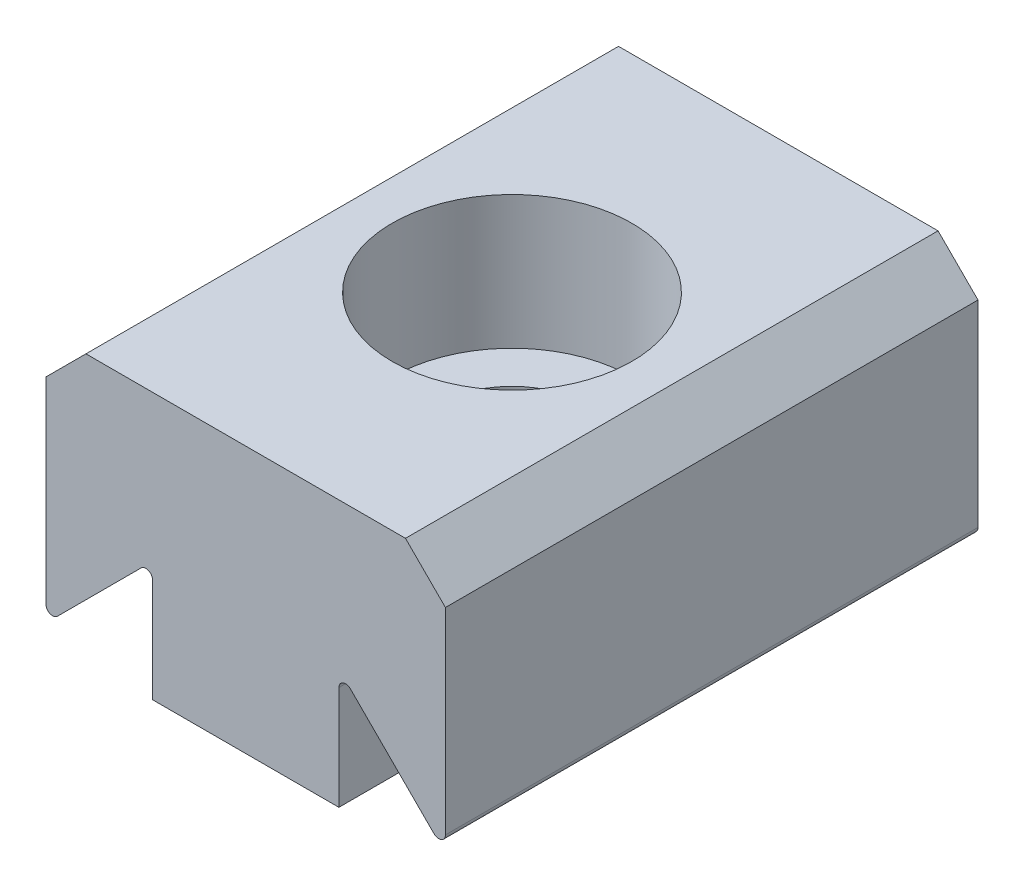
from build123d import *

# Parameters (mm, degrees)
ESQUISSE1_W                                     = 15
ESQUISSE1_H                                     = 10
EXTRUSION1_DEPTH                                = 10
ENL_V_MAT_EXTRU_1_DEPTH                         = 35.974991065
CHANFREIN1_SIZE                                 = 1.5
CHAMBRAGE_POUR_VIS_T_TE_CYLINDRIQUE_D           = 5.5
CHAMBRAGE_POUR_VIS_T_TE_CYLINDRIQUE_DEPTH       = 10
CHAMBRAGE_POUR_VIS_T_TE_CYLINDRIQUE_CBORE_D     = 9
CHAMBRAGE_POUR_VIS_T_TE_CYLINDRIQUE_CBORE_DEPTH = 5
CHAMBRAGE_POUR_VIS_T_TE_CYLINDRIQUE_TIP         = 1.652366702


with BuildPart() as part:
    # Esquisse1 → Extrusion1 (new, symmetric)
    with BuildSketch(Plane.XY):
        with Locations((-3.5, 21.5)):
            Rectangle(ESQUISSE1_W, ESQUISSE1_H)
    extrude(amount=EXTRUSION1_DEPTH, both=True)

    # Esquisse3 → Enl_v. mat.-Extru.1 (cut, through all)
    with BuildSketch(Plane.XY.offset(10)):
        with BuildLine():
            Line((3.573223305, 17.426776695), (0.426776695, 20.573223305))
            ThreePointArc((0.426776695, 20.573223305), (0.154329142, 20.627416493), (0, 20.396446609))
            Line((0, 20.396446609), (0, 11.236942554))
            Line((0, 11.236942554), (9.983970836, 8.27222649))
            Line((9.983970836, 8.27222649), (14.338865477, 16.725437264))
            Line((14.338865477, 16.725437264), (4, 22.051776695))
            Line((4, 22.051776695), (4, 17.603553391))
            ThreePointArc((4, 17.603553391), (3.845670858, 17.372583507), (3.573223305, 17.426776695))
        make_face()
    enl_v_mat_extru_1 = extrude(amount=-ENL_V_MAT_EXTRU_1_DEPTH, mode=Mode.SUBTRACT)

    # Sym_trie1: Enl_v. mat.-Extru.1 across plane
    add(enl_v_mat_extru_1.mirror(Plane.ZY.offset(3.5)), mode=Mode.SUBTRACT)

    # Chanfrein1
    chanfrein1_edges = [part.edges().sort_by_distance(p)[0] for p in [
        (-11, 26.5, 0),
        (4, 26.5, 0),
    ]]
    chamfer(chanfrein1_edges, length=CHANFREIN1_SIZE)

    # Chambrage pour vis _ t_te cylindrique
    with Locations(Plane(origin=(0, 26.5, 0), x_dir=(-1, 0, 0), z_dir=(0, 1, 0))):
        with Locations((3.5, 0)):
            CounterBoreHole(CHAMBRAGE_POUR_VIS_T_TE_CYLINDRIQUE_D / 2, CHAMBRAGE_POUR_VIS_T_TE_CYLINDRIQUE_CBORE_D / 2, CHAMBRAGE_POUR_VIS_T_TE_CYLINDRIQUE_CBORE_DEPTH, depth=CHAMBRAGE_POUR_VIS_T_TE_CYLINDRIQUE_DEPTH)
            with Locations((0, 0, -(CHAMBRAGE_POUR_VIS_T_TE_CYLINDRIQUE_DEPTH + CHAMBRAGE_POUR_VIS_T_TE_CYLINDRIQUE_TIP / 2))):  # 118° drill point
                Cone(0, CHAMBRAGE_POUR_VIS_T_TE_CYLINDRIQUE_D / 2, CHAMBRAGE_POUR_VIS_T_TE_CYLINDRIQUE_TIP, mode=Mode.SUBTRACT)


solid = part.part
